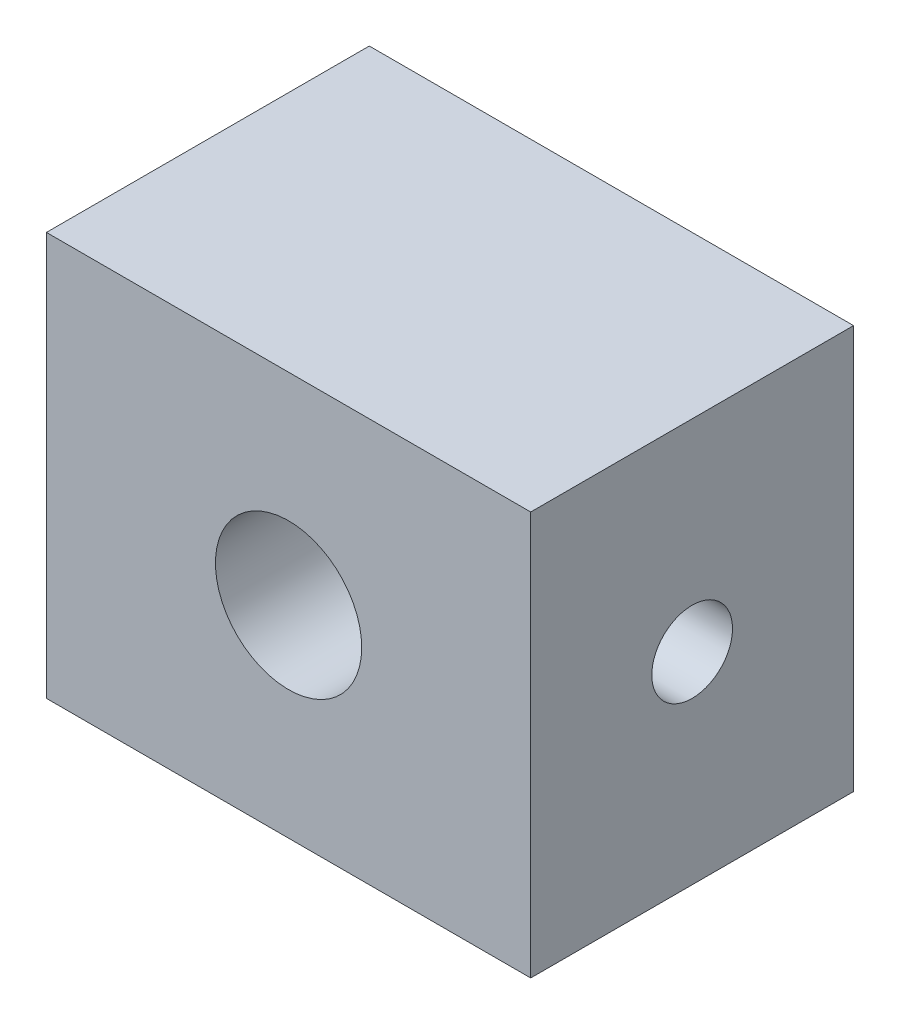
ISO-10303-21;
HEADER;
FILE_DESCRIPTION(('STEP AP214'),'2;1');
FILE_NAME('part.step','',(''),(''),'','','');
FILE_SCHEMA(('AUTOMOTIVE_DESIGN { 1 0 10303 214 1 1 1 1 }'));
ENDSEC;
DATA;
#1=APPLICATION_CONTEXT('core data for automotive mechanical design processes');
#2=APPLICATION_PROTOCOL_DEFINITION('international standard','automotive_design',2000,#1);
#3=PRODUCT_CONTEXT('',#1,'mechanical');
#4=PRODUCT('Part','Part','',(#3));
#5=PRODUCT_RELATED_PRODUCT_CATEGORY('part','',(#4));
#6=PRODUCT_DEFINITION_FORMATION('','',#4);
#7=PRODUCT_DEFINITION_CONTEXT('part definition',#1,'design');
#8=PRODUCT_DEFINITION('design','',#6,#7);
#9=PRODUCT_DEFINITION_SHAPE('','',#8);
#10=(LENGTH_UNIT() NAMED_UNIT(*) SI_UNIT(.MILLI.,.METRE.));
#11=(NAMED_UNIT(*) PLANE_ANGLE_UNIT() SI_UNIT($,.RADIAN.));
#12=(NAMED_UNIT(*) SI_UNIT($,.STERADIAN.) SOLID_ANGLE_UNIT());
#13=UNCERTAINTY_MEASURE_WITH_UNIT(LENGTH_MEASURE(1.E-05),#10,'distance_accuracy_value','');
#14=(GEOMETRIC_REPRESENTATION_CONTEXT(3) GLOBAL_UNCERTAINTY_ASSIGNED_CONTEXT((#13)) GLOBAL_UNIT_ASSIGNED_CONTEXT((#10,
#11,#12)) REPRESENTATION_CONTEXT('',''));
#15=CARTESIAN_POINT('',(0.,0.,0.));
#16=DIRECTION('',(0.,0.,1.));
#17=DIRECTION('',(1.,0.,0.));
#18=AXIS2_PLACEMENT_3D('',#15,#16,#17);
#19=CARTESIAN_POINT('',(19.05,15.875,12.7));
#20=DIRECTION('',(-1.,0.,0.));
#21=DIRECTION('',(0.,0.,1.));
#22=AXIS2_PLACEMENT_3D('',#19,#20,#21);
#23=PLANE('',#22);
#24=CARTESIAN_POINT('',(19.05,0.,0.));
#25=DIRECTION('',(1.,0.,0.));
#26=DIRECTION('',(0.,0.,-1.));
#27=AXIS2_PLACEMENT_3D('',#24,#25,#26);
#28=CIRCLE('',#27,3.175);
#29=CARTESIAN_POINT('',(19.05,0.,-3.175));
#30=VERTEX_POINT('',#29);
#31=EDGE_CURVE('E99',#30,#30,#28,.T.);
#32=ORIENTED_EDGE('',*,*,#31,.F.);
#33=EDGE_LOOP('',(#32));
#34=FACE_BOUND('',#33,.T.);
#35=DIRECTION('',(0.,1.,0.));
#36=VECTOR('',#35,1.);
#37=CARTESIAN_POINT('',(19.05,15.875,-12.7));
#38=LINE('',#37,#36);
#39=CARTESIAN_POINT('',(19.05,-15.875,-12.7));
#40=VERTEX_POINT('',#39);
#41=CARTESIAN_POINT('',(19.05,15.875,-12.7));
#42=VERTEX_POINT('',#41);
#43=EDGE_CURVE('E116',#40,#42,#38,.T.);
#44=ORIENTED_EDGE('',*,*,#43,.T.);
#45=DIRECTION('',(0.,0.,-1.));
#46=VECTOR('',#45,1.);
#47=CARTESIAN_POINT('',(19.05,15.875,12.7));
#48=LINE('',#47,#46);
#49=CARTESIAN_POINT('',(19.05,15.875,12.7));
#50=VERTEX_POINT('',#49);
#51=EDGE_CURVE('E11',#50,#42,#48,.T.);
#52=ORIENTED_EDGE('',*,*,#51,.F.);
#53=DIRECTION('',(0.,1.,0.));
#54=VECTOR('',#53,1.);
#55=CARTESIAN_POINT('',(19.05,15.875,12.7));
#56=LINE('',#55,#54);
#57=CARTESIAN_POINT('',(19.05,-15.875,12.7));
#58=VERTEX_POINT('',#57);
#59=EDGE_CURVE('E117',#58,#50,#56,.T.);
#60=ORIENTED_EDGE('',*,*,#59,.F.);
#61=DIRECTION('',(0.,0.,-1.));
#62=VECTOR('',#61,1.);
#63=CARTESIAN_POINT('',(19.05,-15.875,12.7));
#64=LINE('',#63,#62);
#65=EDGE_CURVE('E123',#58,#40,#64,.T.);
#66=ORIENTED_EDGE('',*,*,#65,.T.);
#67=EDGE_LOOP('',(#44,#52,#60,#66));
#68=FACE_BOUND('',#67,.T.);
#69=ADVANCED_FACE('F35',(#34,#68),#23,.F.);
#70=CARTESIAN_POINT('',(-19.05,15.875,12.7));
#71=DIRECTION('',(0.,-1.,0.));
#72=DIRECTION('',(0.,0.,-1.));
#73=AXIS2_PLACEMENT_3D('',#70,#71,#72);
#74=PLANE('',#73);
#75=DIRECTION('',(-1.,0.,0.));
#76=VECTOR('',#75,1.);
#77=CARTESIAN_POINT('',(-19.05,15.875,-12.7));
#78=LINE('',#77,#76);
#79=CARTESIAN_POINT('',(-19.05,15.875,-12.7));
#80=VERTEX_POINT('',#79);
#81=EDGE_CURVE('E126',#42,#80,#78,.T.);
#82=ORIENTED_EDGE('',*,*,#81,.T.);
#83=DIRECTION('',(0.,0.,-1.));
#84=VECTOR('',#83,1.);
#85=CARTESIAN_POINT('',(-19.05,15.875,12.7));
#86=LINE('',#85,#84);
#87=CARTESIAN_POINT('',(-19.05,15.875,12.7));
#88=VERTEX_POINT('',#87);
#89=EDGE_CURVE('E43',#88,#80,#86,.T.);
#90=ORIENTED_EDGE('',*,*,#89,.F.);
#91=DIRECTION('',(-1.,0.,0.));
#92=VECTOR('',#91,1.);
#93=CARTESIAN_POINT('',(-19.05,15.875,12.7));
#94=LINE('',#93,#92);
#95=EDGE_CURVE('E82',#50,#88,#94,.T.);
#96=ORIENTED_EDGE('',*,*,#95,.F.);
#97=ORIENTED_EDGE('',*,*,#51,.T.);
#98=EDGE_LOOP('',(#82,#90,#96,#97));
#99=FACE_BOUND('',#98,.T.);
#100=ADVANCED_FACE('F152',(#99),#74,.F.);
#101=CARTESIAN_POINT('',(-19.05,15.875,12.7));
#102=DIRECTION('',(1.,0.,0.));
#103=DIRECTION('',(0.,0.,-1.));
#104=AXIS2_PLACEMENT_3D('',#101,#102,#103);
#105=PLANE('',#104);
#106=CARTESIAN_POINT('',(-19.05,0.,0.));
#107=DIRECTION('',(-1.,0.,0.));
#108=DIRECTION('',(0.,0.,1.));
#109=AXIS2_PLACEMENT_3D('',#106,#107,#108);
#110=CIRCLE('',#109,3.175);
#111=CARTESIAN_POINT('',(-19.05,0.,3.175));
#112=VERTEX_POINT('',#111);
#113=EDGE_CURVE('E100',#112,#112,#110,.T.);
#114=ORIENTED_EDGE('',*,*,#113,.F.);
#115=EDGE_LOOP('',(#114));
#116=FACE_BOUND('',#115,.T.);
#117=DIRECTION('',(0.,-1.,0.));
#118=VECTOR('',#117,1.);
#119=CARTESIAN_POINT('',(-19.05,15.875,-12.7));
#120=LINE('',#119,#118);
#121=CARTESIAN_POINT('',(-19.05,-15.875,-12.7));
#122=VERTEX_POINT('',#121);
#123=EDGE_CURVE('E69',#80,#122,#120,.T.);
#124=ORIENTED_EDGE('',*,*,#123,.T.);
#125=DIRECTION('',(0.,0.,-1.));
#126=VECTOR('',#125,1.);
#127=CARTESIAN_POINT('',(-19.05,-15.875,12.7));
#128=LINE('',#127,#126);
#129=CARTESIAN_POINT('',(-19.05,-15.875,12.7));
#130=VERTEX_POINT('',#129);
#131=EDGE_CURVE('E131',#130,#122,#128,.T.);
#132=ORIENTED_EDGE('',*,*,#131,.F.);
#133=DIRECTION('',(0.,-1.,0.));
#134=VECTOR('',#133,1.);
#135=CARTESIAN_POINT('',(-19.05,15.875,12.7));
#136=LINE('',#135,#134);
#137=EDGE_CURVE('E120',#88,#130,#136,.T.);
#138=ORIENTED_EDGE('',*,*,#137,.F.);
#139=ORIENTED_EDGE('',*,*,#89,.T.);
#140=EDGE_LOOP('',(#124,#132,#138,#139));
#141=FACE_BOUND('',#140,.T.);
#142=ADVANCED_FACE('F133',(#116,#141),#105,.F.);
#143=CARTESIAN_POINT('',(-19.05,-15.875,12.7));
#144=DIRECTION('',(0.,1.,0.));
#145=DIRECTION('',(0.,0.,1.));
#146=AXIS2_PLACEMENT_3D('',#143,#144,#145);
#147=PLANE('',#146);
#148=DIRECTION('',(1.,0.,0.));
#149=VECTOR('',#148,1.);
#150=CARTESIAN_POINT('',(-19.05,-15.875,-12.7));
#151=LINE('',#150,#149);
#152=EDGE_CURVE('E75',#122,#40,#151,.T.);
#153=ORIENTED_EDGE('',*,*,#152,.T.);
#154=ORIENTED_EDGE('',*,*,#65,.F.);
#155=DIRECTION('',(1.,0.,0.));
#156=VECTOR('',#155,1.);
#157=CARTESIAN_POINT('',(-19.05,-15.875,12.7));
#158=LINE('',#157,#156);
#159=EDGE_CURVE('E51',#130,#58,#158,.T.);
#160=ORIENTED_EDGE('',*,*,#159,.F.);
#161=ORIENTED_EDGE('',*,*,#131,.T.);
#162=EDGE_LOOP('',(#153,#154,#160,#161));
#163=FACE_BOUND('',#162,.T.);
#164=ADVANCED_FACE('F140',(#163),#147,.F.);
#165=CARTESIAN_POINT('',(0.,0.,12.7));
#166=DIRECTION('',(0.,0.,1.));
#167=DIRECTION('',(1.,0.,0.));
#168=AXIS2_PLACEMENT_3D('',#165,#166,#167);
#169=PLANE('',#168);
#170=CARTESIAN_POINT('',(0.,0.,12.7));
#171=DIRECTION('',(0.,0.,1.));
#172=DIRECTION('',(1.,0.,0.));
#173=AXIS2_PLACEMENT_3D('',#170,#171,#172);
#174=CIRCLE('',#173,5.75436999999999);
#175=CARTESIAN_POINT('',(5.75436999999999,0.,12.7));
#176=VERTEX_POINT('',#175);
#177=EDGE_CURVE('E110',#176,#176,#174,.T.);
#178=ORIENTED_EDGE('',*,*,#177,.F.);
#179=EDGE_LOOP('',(#178));
#180=FACE_BOUND('',#179,.T.);
#181=ORIENTED_EDGE('',*,*,#59,.T.);
#182=ORIENTED_EDGE('',*,*,#95,.T.);
#183=ORIENTED_EDGE('',*,*,#137,.T.);
#184=ORIENTED_EDGE('',*,*,#159,.T.);
#185=EDGE_LOOP('',(#181,#182,#183,#184));
#186=FACE_BOUND('',#185,.T.);
#187=ADVANCED_FACE('F142',(#180,#186),#169,.T.);
#188=CARTESIAN_POINT('',(0.,0.,-12.7));
#189=DIRECTION('',(0.,0.,1.));
#190=DIRECTION('',(1.,0.,0.));
#191=AXIS2_PLACEMENT_3D('',#188,#189,#190);
#192=PLANE('',#191);
#193=CARTESIAN_POINT('',(0.,0.,-12.7));
#194=DIRECTION('',(0.,0.,1.));
#195=DIRECTION('',(1.,0.,0.));
#196=AXIS2_PLACEMENT_3D('',#193,#194,#195);
#197=CIRCLE('',#196,5.75436999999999);
#198=CARTESIAN_POINT('',(5.75436999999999,0.,-12.7));
#199=VERTEX_POINT('',#198);
#200=EDGE_CURVE('E113',#199,#199,#197,.T.);
#201=ORIENTED_EDGE('',*,*,#200,.T.);
#202=EDGE_LOOP('',(#201));
#203=FACE_BOUND('',#202,.T.);
#204=ORIENTED_EDGE('',*,*,#43,.F.);
#205=ORIENTED_EDGE('',*,*,#152,.F.);
#206=ORIENTED_EDGE('',*,*,#123,.F.);
#207=ORIENTED_EDGE('',*,*,#81,.F.);
#208=EDGE_LOOP('',(#204,#205,#206,#207));
#209=FACE_BOUND('',#208,.T.);
#210=ADVANCED_FACE('F136',(#203,#209),#192,.F.);
#211=CARTESIAN_POINT('',(0.,0.,12.7));
#212=DIRECTION('',(0.,0.,1.));
#213=DIRECTION('',(1.,0.,0.));
#214=AXIS2_PLACEMENT_3D('',#211,#212,#213);
#215=CYLINDRICAL_SURFACE('',#214,5.75436999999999);
#216=ORIENTED_EDGE('',*,*,#200,.F.);
#217=EDGE_LOOP('',(#216));
#218=FACE_BOUND('',#217,.T.);
#219=ORIENTED_EDGE('',*,*,#177,.T.);
#220=EDGE_LOOP('',(#219));
#221=FACE_BOUND('',#220,.T.);
#222=ADVANCED_FACE('F172',(#218,#221),#215,.F.);
#223=CARTESIAN_POINT('',(10.16,0.,0.));
#224=DIRECTION('',(1.,0.,0.));
#225=DIRECTION('',(0.,0.,-1.));
#226=AXIS2_PLACEMENT_3D('',#223,#224,#225);
#227=CONICAL_SURFACE('',#226,3.175,1.02974425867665);
#228=CARTESIAN_POINT('',(8.2522675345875,0.,0.));
#229=VERTEX_POINT('',#228);
#230=VERTEX_LOOP('',#229);
#231=FACE_BOUND('',#230,.T.);
#232=CARTESIAN_POINT('',(10.16,0.,0.));
#233=DIRECTION('',(1.,0.,0.));
#234=DIRECTION('',(0.,0.,-1.));
#235=AXIS2_PLACEMENT_3D('',#232,#233,#234);
#236=CIRCLE('',#235,3.175);
#237=CARTESIAN_POINT('',(10.16,0.,-3.175));
#238=VERTEX_POINT('',#237);
#239=EDGE_CURVE('E103',#238,#238,#236,.T.);
#240=ORIENTED_EDGE('',*,*,#239,.T.);
#241=EDGE_LOOP('',(#240));
#242=FACE_BOUND('',#241,.T.);
#243=ADVANCED_FACE('F166',(#231,#242),#227,.F.);
#244=CARTESIAN_POINT('',(19.05,0.,0.));
#245=DIRECTION('',(1.,0.,0.));
#246=DIRECTION('',(0.,0.,-1.));
#247=AXIS2_PLACEMENT_3D('',#244,#245,#246);
#248=CYLINDRICAL_SURFACE('',#247,3.175);
#249=ORIENTED_EDGE('',*,*,#239,.F.);
#250=EDGE_LOOP('',(#249));
#251=FACE_BOUND('',#250,.T.);
#252=ORIENTED_EDGE('',*,*,#31,.T.);
#253=EDGE_LOOP('',(#252));
#254=FACE_BOUND('',#253,.T.);
#255=ADVANCED_FACE('F93',(#251,#254),#248,.F.);
#256=CARTESIAN_POINT('',(-10.16,0.,0.));
#257=DIRECTION('',(-1.,0.,0.));
#258=DIRECTION('',(0.,0.,1.));
#259=AXIS2_PLACEMENT_3D('',#256,#257,#258);
#260=CONICAL_SURFACE('',#259,3.175,1.02974425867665);
#261=CARTESIAN_POINT('',(-8.2522675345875,0.,0.));
#262=VERTEX_POINT('',#261);
#263=VERTEX_LOOP('',#262);
#264=FACE_BOUND('',#263,.T.);
#265=CARTESIAN_POINT('',(-10.16,0.,0.));
#266=DIRECTION('',(-1.,0.,0.));
#267=DIRECTION('',(0.,0.,1.));
#268=AXIS2_PLACEMENT_3D('',#265,#266,#267);
#269=CIRCLE('',#268,3.175);
#270=CARTESIAN_POINT('',(-10.16,0.,3.175));
#271=VERTEX_POINT('',#270);
#272=EDGE_CURVE('E97',#271,#271,#269,.T.);
#273=ORIENTED_EDGE('',*,*,#272,.T.);
#274=EDGE_LOOP('',(#273));
#275=FACE_BOUND('',#274,.T.);
#276=ADVANCED_FACE('F89',(#264,#275),#260,.F.);
#277=CARTESIAN_POINT('',(-19.05,0.,0.));
#278=DIRECTION('',(-1.,0.,0.));
#279=DIRECTION('',(0.,0.,1.));
#280=AXIS2_PLACEMENT_3D('',#277,#278,#279);
#281=CYLINDRICAL_SURFACE('',#280,3.175);
#282=ORIENTED_EDGE('',*,*,#272,.F.);
#283=EDGE_LOOP('',(#282));
#284=FACE_BOUND('',#283,.T.);
#285=ORIENTED_EDGE('',*,*,#113,.T.);
#286=EDGE_LOOP('',(#285));
#287=FACE_BOUND('',#286,.T.);
#288=ADVANCED_FACE('F92',(#284,#287),#281,.F.);
#289=CLOSED_SHELL('',(#69,#100,#142,#164,#187,#210,#222,#243,#255,#276,#288));
#290=MANIFOLD_SOLID_BREP('B2',#289);
#291=ADVANCED_BREP_SHAPE_REPRESENTATION('',(#18,#290),#14);
#292=SHAPE_DEFINITION_REPRESENTATION(#9,#291);
ENDSEC;
END-ISO-10303-21;
